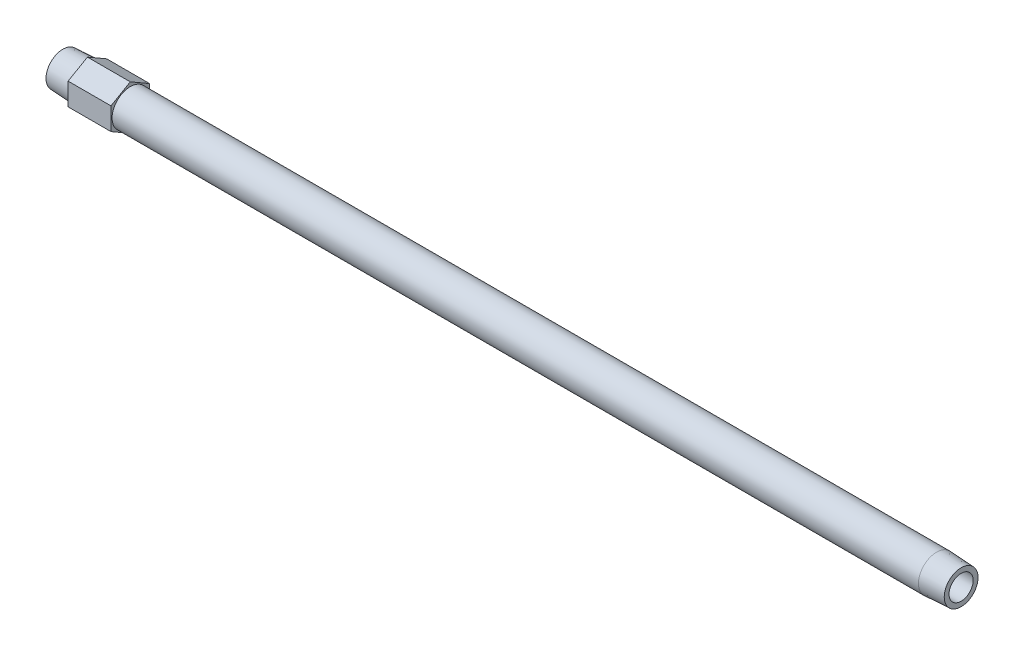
ISO-10303-21;
HEADER;
FILE_DESCRIPTION(('STEP AP214'),'2;1');
FILE_NAME('part.step','',(''),(''),'','','');
FILE_SCHEMA(('AUTOMOTIVE_DESIGN { 1 0 10303 214 1 1 1 1 }'));
ENDSEC;
DATA;
#1=APPLICATION_CONTEXT('core data for automotive mechanical design processes');
#2=APPLICATION_PROTOCOL_DEFINITION('international standard','automotive_design',2000,#1);
#3=PRODUCT_CONTEXT('',#1,'mechanical');
#4=PRODUCT('Part','Part','',(#3));
#5=PRODUCT_RELATED_PRODUCT_CATEGORY('part','',(#4));
#6=PRODUCT_DEFINITION_FORMATION('','',#4);
#7=PRODUCT_DEFINITION_CONTEXT('part definition',#1,'design');
#8=PRODUCT_DEFINITION('design','',#6,#7);
#9=PRODUCT_DEFINITION_SHAPE('','',#8);
#10=(LENGTH_UNIT() NAMED_UNIT(*) SI_UNIT(.MILLI.,.METRE.));
#11=(NAMED_UNIT(*) PLANE_ANGLE_UNIT() SI_UNIT($,.RADIAN.));
#12=(NAMED_UNIT(*) SI_UNIT($,.STERADIAN.) SOLID_ANGLE_UNIT());
#13=UNCERTAINTY_MEASURE_WITH_UNIT(LENGTH_MEASURE(1.E-05),#10,'distance_accuracy_value','');
#14=(GEOMETRIC_REPRESENTATION_CONTEXT(3) GLOBAL_UNCERTAINTY_ASSIGNED_CONTEXT((#13)) GLOBAL_UNIT_ASSIGNED_CONTEXT((#10,
#11,#12)) REPRESENTATION_CONTEXT('',''));
#15=CARTESIAN_POINT('',(0.,0.,0.));
#16=DIRECTION('',(0.,0.,1.));
#17=DIRECTION('',(1.,0.,0.));
#18=AXIS2_PLACEMENT_3D('',#15,#16,#17);
#19=CARTESIAN_POINT('',(0.,0.,-4.78009397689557));
#20=DIRECTION('',(1.,0.,0.));
#21=DIRECTION('',(0.,0.,-1.));
#22=AXIS2_PLACEMENT_3D('',#19,#20,#21);
#23=PLANE('',#22);
#24=CARTESIAN_POINT('',(0.,0.,0.));
#25=DIRECTION('',(-1.,0.,0.));
#26=DIRECTION('',(0.,0.,1.));
#27=AXIS2_PLACEMENT_3D('',#24,#25,#26);
#28=CIRCLE('',#27,4.78009397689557);
#29=CARTESIAN_POINT('',(0.,0.,4.78009397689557));
#30=VERTEX_POINT('',#29);
#31=EDGE_CURVE('E147',#30,#30,#28,.T.);
#32=ORIENTED_EDGE('',*,*,#31,.T.);
#33=EDGE_LOOP('',(#32));
#34=FACE_BOUND('',#33,.T.);
#35=CARTESIAN_POINT('',(0.,0.,0.));
#36=DIRECTION('',(1.,0.,0.));
#37=DIRECTION('',(0.,0.,1.));
#38=AXIS2_PLACEMENT_3D('',#35,#36,#37);
#39=CIRCLE('',#38,3.4163);
#40=CARTESIAN_POINT('',(0.,0.,3.4163));
#41=VERTEX_POINT('',#40);
#42=EDGE_CURVE('E159',#41,#41,#39,.T.);
#43=ORIENTED_EDGE('',*,*,#42,.T.);
#44=EDGE_LOOP('',(#43));
#45=FACE_BOUND('',#44,.T.);
#46=ADVANCED_FACE('F15',(#34,#45),#23,.F.);
#47=CARTESIAN_POINT('',(254.,0.,-4.78009397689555));
#48=DIRECTION('',(-1.,0.,0.));
#49=DIRECTION('',(0.,0.,1.));
#50=AXIS2_PLACEMENT_3D('',#47,#48,#49);
#51=PLANE('',#50);
#52=CARTESIAN_POINT('',(254.,0.,0.));
#53=DIRECTION('',(-1.,0.,0.));
#54=DIRECTION('',(0.,0.,1.));
#55=AXIS2_PLACEMENT_3D('',#52,#53,#54);
#56=CIRCLE('',#55,4.78009397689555);
#57=CARTESIAN_POINT('',(254.,0.,4.78009397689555));
#58=VERTEX_POINT('',#57);
#59=EDGE_CURVE('E150',#58,#58,#56,.T.);
#60=ORIENTED_EDGE('',*,*,#59,.F.);
#61=EDGE_LOOP('',(#60));
#62=FACE_BOUND('',#61,.T.);
#63=CARTESIAN_POINT('',(254.,0.,0.));
#64=DIRECTION('',(-1.,0.,0.));
#65=DIRECTION('',(0.,0.,1.));
#66=AXIS2_PLACEMENT_3D('',#63,#64,#65);
#67=CIRCLE('',#66,3.4163);
#68=CARTESIAN_POINT('',(254.,0.,3.4163));
#69=VERTEX_POINT('',#68);
#70=EDGE_CURVE('E156',#69,#69,#67,.F.);
#71=ORIENTED_EDGE('',*,*,#70,.F.);
#72=EDGE_LOOP('',(#71));
#73=FACE_BOUND('',#72,.T.);
#74=ADVANCED_FACE('F178',(#62,#73),#51,.F.);
#75=CARTESIAN_POINT('',(19.05,-9.45872946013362,5.461));
#76=DIRECTION('',(-1.,0.,0.));
#77=DIRECTION('',(0.,-1.,0.));
#78=AXIS2_PLACEMENT_3D('',#75,#76,#77);
#79=PLANE('',#78);
#80=DIRECTION('',(0.,0.5,-0.866025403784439));
#81=VECTOR('',#80,1.);
#82=CARTESIAN_POINT('',(19.05,-6.30581964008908,0.));
#83=LINE('',#82,#81);
#84=CARTESIAN_POINT('',(19.05,-6.30581964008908,0.));
#85=VERTEX_POINT('',#84);
#86=CARTESIAN_POINT('',(19.05,-3.15290982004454,-5.461));
#87=VERTEX_POINT('',#86);
#88=EDGE_CURVE('E103',#85,#87,#83,.T.);
#89=ORIENTED_EDGE('',*,*,#88,.T.);
#90=DIRECTION('',(0.,1.,0.));
#91=VECTOR('',#90,1.);
#92=CARTESIAN_POINT('',(19.05,-3.15290982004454,-5.461));
#93=LINE('',#92,#91);
#94=CARTESIAN_POINT('',(19.05,3.15290982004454,-5.461));
#95=VERTEX_POINT('',#94);
#96=EDGE_CURVE('E83',#87,#95,#93,.T.);
#97=ORIENTED_EDGE('',*,*,#96,.T.);
#98=DIRECTION('',(0.,0.5,0.866025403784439));
#99=VECTOR('',#98,1.);
#100=CARTESIAN_POINT('',(19.05,3.15290982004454,-5.461));
#101=LINE('',#100,#99);
#102=CARTESIAN_POINT('',(19.05,6.30581964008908,0.));
#103=VERTEX_POINT('',#102);
#104=EDGE_CURVE('E102',#95,#103,#101,.T.);
#105=ORIENTED_EDGE('',*,*,#104,.T.);
#106=DIRECTION('',(0.,-0.5,0.866025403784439));
#107=VECTOR('',#106,1.);
#108=CARTESIAN_POINT('',(19.05,6.30581964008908,0.));
#109=LINE('',#108,#107);
#110=CARTESIAN_POINT('',(19.05,3.15290982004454,5.461));
#111=VERTEX_POINT('',#110);
#112=EDGE_CURVE('E105',#103,#111,#109,.T.);
#113=ORIENTED_EDGE('',*,*,#112,.T.);
#114=DIRECTION('',(0.,-1.,0.));
#115=VECTOR('',#114,1.);
#116=CARTESIAN_POINT('',(19.05,3.15290982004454,5.461));
#117=LINE('',#116,#115);
#118=CARTESIAN_POINT('',(19.05,-3.15290982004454,5.461));
#119=VERTEX_POINT('',#118);
#120=EDGE_CURVE('E35',#111,#119,#117,.T.);
#121=ORIENTED_EDGE('',*,*,#120,.T.);
#122=DIRECTION('',(0.,-0.5,-0.866025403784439));
#123=VECTOR('',#122,1.);
#124=CARTESIAN_POINT('',(19.05,-3.15290982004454,5.461));
#125=LINE('',#124,#123);
#126=EDGE_CURVE('E30',#119,#85,#125,.T.);
#127=ORIENTED_EDGE('',*,*,#126,.T.);
#128=EDGE_LOOP('',(#89,#97,#105,#113,#121,#127));
#129=FACE_BOUND('',#128,.T.);
#130=CARTESIAN_POINT('',(19.05,0.,0.));
#131=DIRECTION('',(-1.,0.,0.));
#132=DIRECTION('',(0.,-1.,0.));
#133=AXIS2_PLACEMENT_3D('',#130,#131,#132);
#134=CIRCLE('',#133,5.1435);
#135=CARTESIAN_POINT('',(19.05,-5.1435,0.));
#136=VERTEX_POINT('',#135);
#137=EDGE_CURVE('E89',#136,#136,#134,.F.);
#138=ORIENTED_EDGE('',*,*,#137,.F.);
#139=EDGE_LOOP('',(#138));
#140=FACE_BOUND('',#139,.T.);
#141=ADVANCED_FACE('F124',(#129,#140),#79,.F.);
#142=CARTESIAN_POINT('',(6.9342,-9.45872946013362,5.461));
#143=DIRECTION('',(-1.,0.,0.));
#144=DIRECTION('',(0.,-1.,0.));
#145=AXIS2_PLACEMENT_3D('',#142,#143,#144);
#146=PLANE('',#145);
#147=DIRECTION('',(0.,0.5,-0.866025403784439));
#148=VECTOR('',#147,1.);
#149=CARTESIAN_POINT('',(6.9342,-6.30581964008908,0.));
#150=LINE('',#149,#148);
#151=CARTESIAN_POINT('',(6.9342,-6.30581964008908,0.));
#152=VERTEX_POINT('',#151);
#153=CARTESIAN_POINT('',(6.9342,-3.15290982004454,-5.461));
#154=VERTEX_POINT('',#153);
#155=EDGE_CURVE('E73',#152,#154,#150,.T.);
#156=ORIENTED_EDGE('',*,*,#155,.F.);
#157=DIRECTION('',(0.,-0.5,-0.866025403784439));
#158=VECTOR('',#157,1.);
#159=CARTESIAN_POINT('',(6.9342,-3.15290982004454,5.461));
#160=LINE('',#159,#158);
#161=CARTESIAN_POINT('',(6.9342,-3.15290982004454,5.461));
#162=VERTEX_POINT('',#161);
#163=EDGE_CURVE('E99',#162,#152,#160,.T.);
#164=ORIENTED_EDGE('',*,*,#163,.F.);
#165=DIRECTION('',(0.,-1.,0.));
#166=VECTOR('',#165,1.);
#167=CARTESIAN_POINT('',(6.9342,3.15290982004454,5.461));
#168=LINE('',#167,#166);
#169=CARTESIAN_POINT('',(6.9342,3.15290982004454,5.461));
#170=VERTEX_POINT('',#169);
#171=EDGE_CURVE('E133',#170,#162,#168,.T.);
#172=ORIENTED_EDGE('',*,*,#171,.F.);
#173=DIRECTION('',(0.,-0.5,0.866025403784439));
#174=VECTOR('',#173,1.);
#175=CARTESIAN_POINT('',(6.9342,6.30581964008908,0.));
#176=LINE('',#175,#174);
#177=CARTESIAN_POINT('',(6.9342,6.30581964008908,0.));
#178=VERTEX_POINT('',#177);
#179=EDGE_CURVE('E129',#178,#170,#176,.T.);
#180=ORIENTED_EDGE('',*,*,#179,.F.);
#181=DIRECTION('',(0.,0.5,0.866025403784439));
#182=VECTOR('',#181,1.);
#183=CARTESIAN_POINT('',(6.9342,3.15290982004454,-5.461));
#184=LINE('',#183,#182);
#185=CARTESIAN_POINT('',(6.9342,3.15290982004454,-5.461));
#186=VERTEX_POINT('',#185);
#187=EDGE_CURVE('E75',#186,#178,#184,.T.);
#188=ORIENTED_EDGE('',*,*,#187,.F.);
#189=DIRECTION('',(0.,1.,0.));
#190=VECTOR('',#189,1.);
#191=CARTESIAN_POINT('',(6.9342,-3.15290982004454,-5.461));
#192=LINE('',#191,#190);
#193=EDGE_CURVE('E68',#154,#186,#192,.T.);
#194=ORIENTED_EDGE('',*,*,#193,.F.);
#195=EDGE_LOOP('',(#156,#164,#172,#180,#188,#194));
#196=FACE_BOUND('',#195,.T.);
#197=CARTESIAN_POINT('',(6.9342,0.,0.));
#198=DIRECTION('',(-1.,0.,0.));
#199=DIRECTION('',(0.,0.,1.));
#200=AXIS2_PLACEMENT_3D('',#197,#198,#199);
#201=CIRCLE('',#200,5.1435);
#202=CARTESIAN_POINT('',(6.9342,0.,5.1435));
#203=VERTEX_POINT('',#202);
#204=EDGE_CURVE('E95',#203,#203,#201,.T.);
#205=ORIENTED_EDGE('',*,*,#204,.F.);
#206=EDGE_LOOP('',(#205));
#207=FACE_BOUND('',#206,.T.);
#208=ADVANCED_FACE('F69',(#196,#207),#146,.T.);
#209=CARTESIAN_POINT('',(19.05,-6.30581964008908,0.));
#210=DIRECTION('',(0.,0.866025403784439,0.5));
#211=DIRECTION('',(0.,-0.5,0.866025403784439));
#212=AXIS2_PLACEMENT_3D('',#209,#210,#211);
#213=PLANE('',#212);
#214=ORIENTED_EDGE('',*,*,#155,.T.);
#215=DIRECTION('',(-1.,0.,0.));
#216=VECTOR('',#215,1.);
#217=CARTESIAN_POINT('',(19.05,-3.15290982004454,-5.461));
#218=LINE('',#217,#216);
#219=EDGE_CURVE('E10',#87,#154,#218,.T.);
#220=ORIENTED_EDGE('',*,*,#219,.F.);
#221=ORIENTED_EDGE('',*,*,#88,.F.);
#222=DIRECTION('',(-1.,0.,0.));
#223=VECTOR('',#222,1.);
#224=CARTESIAN_POINT('',(19.05,-6.30581964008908,0.));
#225=LINE('',#224,#223);
#226=EDGE_CURVE('E87',#85,#152,#225,.T.);
#227=ORIENTED_EDGE('',*,*,#226,.T.);
#228=EDGE_LOOP('',(#214,#220,#221,#227));
#229=FACE_BOUND('',#228,.T.);
#230=ADVANCED_FACE('F17',(#229),#213,.F.);
#231=CARTESIAN_POINT('',(19.05,-3.15290982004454,-5.461));
#232=DIRECTION('',(0.,0.,1.));
#233=DIRECTION('',(0.,-1.,0.));
#234=AXIS2_PLACEMENT_3D('',#231,#232,#233);
#235=PLANE('',#234);
#236=ORIENTED_EDGE('',*,*,#193,.T.);
#237=DIRECTION('',(-1.,0.,0.));
#238=VECTOR('',#237,1.);
#239=CARTESIAN_POINT('',(19.05,3.15290982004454,-5.461));
#240=LINE('',#239,#238);
#241=EDGE_CURVE('E23',#95,#186,#240,.T.);
#242=ORIENTED_EDGE('',*,*,#241,.F.);
#243=ORIENTED_EDGE('',*,*,#96,.F.);
#244=ORIENTED_EDGE('',*,*,#219,.T.);
#245=EDGE_LOOP('',(#236,#242,#243,#244));
#246=FACE_BOUND('',#245,.T.);
#247=ADVANCED_FACE('F82',(#246),#235,.F.);
#248=CARTESIAN_POINT('',(19.05,3.15290982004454,-5.461));
#249=DIRECTION('',(0.,-0.866025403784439,0.5));
#250=DIRECTION('',(0.,-0.5,-0.866025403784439));
#251=AXIS2_PLACEMENT_3D('',#248,#249,#250);
#252=PLANE('',#251);
#253=ORIENTED_EDGE('',*,*,#187,.T.);
#254=DIRECTION('',(-1.,0.,0.));
#255=VECTOR('',#254,1.);
#256=CARTESIAN_POINT('',(19.05,6.30581964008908,0.));
#257=LINE('',#256,#255);
#258=EDGE_CURVE('E117',#103,#178,#257,.T.);
#259=ORIENTED_EDGE('',*,*,#258,.F.);
#260=ORIENTED_EDGE('',*,*,#104,.F.);
#261=ORIENTED_EDGE('',*,*,#241,.T.);
#262=EDGE_LOOP('',(#253,#259,#260,#261));
#263=FACE_BOUND('',#262,.T.);
#264=ADVANCED_FACE('F121',(#263),#252,.F.);
#265=CARTESIAN_POINT('',(19.05,6.30581964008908,0.));
#266=DIRECTION('',(0.,-0.866025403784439,-0.5));
#267=DIRECTION('',(0.,0.5,-0.866025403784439));
#268=AXIS2_PLACEMENT_3D('',#265,#266,#267);
#269=PLANE('',#268);
#270=ORIENTED_EDGE('',*,*,#179,.T.);
#271=DIRECTION('',(-1.,0.,0.));
#272=VECTOR('',#271,1.);
#273=CARTESIAN_POINT('',(19.05,3.15290982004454,5.461));
#274=LINE('',#273,#272);
#275=EDGE_CURVE('E114',#111,#170,#274,.T.);
#276=ORIENTED_EDGE('',*,*,#275,.F.);
#277=ORIENTED_EDGE('',*,*,#112,.F.);
#278=ORIENTED_EDGE('',*,*,#258,.T.);
#279=EDGE_LOOP('',(#270,#276,#277,#278));
#280=FACE_BOUND('',#279,.T.);
#281=ADVANCED_FACE('F128',(#280),#269,.F.);
#282=CARTESIAN_POINT('',(19.05,3.15290982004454,5.461));
#283=DIRECTION('',(0.,0.,-1.));
#284=DIRECTION('',(-1.,0.,0.));
#285=AXIS2_PLACEMENT_3D('',#282,#283,#284);
#286=PLANE('',#285);
#287=ORIENTED_EDGE('',*,*,#171,.T.);
#288=DIRECTION('',(-1.,0.,0.));
#289=VECTOR('',#288,1.);
#290=CARTESIAN_POINT('',(19.05,-3.15290982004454,5.461));
#291=LINE('',#290,#289);
#292=EDGE_CURVE('E111',#119,#162,#291,.T.);
#293=ORIENTED_EDGE('',*,*,#292,.F.);
#294=ORIENTED_EDGE('',*,*,#120,.F.);
#295=ORIENTED_EDGE('',*,*,#275,.T.);
#296=EDGE_LOOP('',(#287,#293,#294,#295));
#297=FACE_BOUND('',#296,.T.);
#298=ADVANCED_FACE('F132',(#297),#286,.F.);
#299=CARTESIAN_POINT('',(19.05,-3.15290982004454,5.461));
#300=DIRECTION('',(0.,0.866025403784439,-0.5));
#301=DIRECTION('',(0.,0.5,0.866025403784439));
#302=AXIS2_PLACEMENT_3D('',#299,#300,#301);
#303=PLANE('',#302);
#304=ORIENTED_EDGE('',*,*,#163,.T.);
#305=ORIENTED_EDGE('',*,*,#226,.F.);
#306=ORIENTED_EDGE('',*,*,#126,.F.);
#307=ORIENTED_EDGE('',*,*,#292,.T.);
#308=EDGE_LOOP('',(#304,#305,#306,#307));
#309=FACE_BOUND('',#308,.T.);
#310=ADVANCED_FACE('F135',(#309),#303,.F.);
#311=CARTESIAN_POINT('',(6.9342,0.,0.));
#312=DIRECTION('',(1.,0.,0.));
#313=DIRECTION('',(0.,0.,-1.));
#314=AXIS2_PLACEMENT_3D('',#311,#312,#313);
#315=CONICAL_SURFACE('',#314,5.1435,0.0523598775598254);
#316=ORIENTED_EDGE('',*,*,#31,.F.);
#317=EDGE_LOOP('',(#316));
#318=FACE_BOUND('',#317,.T.);
#319=ORIENTED_EDGE('',*,*,#204,.T.);
#320=EDGE_LOOP('',(#319));
#321=FACE_BOUND('',#320,.T.);
#322=ADVANCED_FACE('F187',(#318,#321),#315,.T.);
#323=CARTESIAN_POINT('',(-60.,0.,0.));
#324=DIRECTION('',(-1.,0.,0.));
#325=DIRECTION('',(0.,0.,1.));
#326=AXIS2_PLACEMENT_3D('',#323,#324,#325);
#327=CYLINDRICAL_SURFACE('',#326,5.1435);
#328=ORIENTED_EDGE('',*,*,#137,.T.);
#329=EDGE_LOOP('',(#328));
#330=FACE_BOUND('',#329,.T.);
#331=CARTESIAN_POINT('',(247.0658,0.,0.));
#332=DIRECTION('',(-1.,0.,0.));
#333=DIRECTION('',(0.,0.,1.));
#334=AXIS2_PLACEMENT_3D('',#331,#332,#333);
#335=CIRCLE('',#334,5.1435);
#336=CARTESIAN_POINT('',(247.0658,0.,5.1435));
#337=VERTEX_POINT('',#336);
#338=EDGE_CURVE('E153',#337,#337,#335,.T.);
#339=ORIENTED_EDGE('',*,*,#338,.T.);
#340=EDGE_LOOP('',(#339));
#341=FACE_BOUND('',#340,.T.);
#342=ADVANCED_FACE('F174',(#330,#341),#327,.T.);
#343=CARTESIAN_POINT('',(254.,0.,0.));
#344=DIRECTION('',(-1.,0.,0.));
#345=DIRECTION('',(0.,0.,1.));
#346=AXIS2_PLACEMENT_3D('',#343,#344,#345);
#347=CONICAL_SURFACE('',#346,4.78009397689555,0.052359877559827);
#348=ORIENTED_EDGE('',*,*,#338,.F.);
#349=EDGE_LOOP('',(#348));
#350=FACE_BOUND('',#349,.T.);
#351=ORIENTED_EDGE('',*,*,#59,.T.);
#352=EDGE_LOOP('',(#351));
#353=FACE_BOUND('',#352,.T.);
#354=ADVANCED_FACE('F167',(#350,#353),#347,.T.);
#355=CARTESIAN_POINT('',(254.547330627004,0.,0.));
#356=DIRECTION('',(-1.,0.,0.));
#357=DIRECTION('',(0.,0.,1.));
#358=AXIS2_PLACEMENT_3D('',#355,#356,#357);
#359=CYLINDRICAL_SURFACE('',#358,3.4163);
#360=ORIENTED_EDGE('',*,*,#70,.T.);
#361=EDGE_LOOP('',(#360));
#362=FACE_BOUND('',#361,.T.);
#363=ORIENTED_EDGE('',*,*,#42,.F.);
#364=EDGE_LOOP('',(#363));
#365=FACE_BOUND('',#364,.T.);
#366=ADVANCED_FACE('F165',(#362,#365),#359,.F.);
#367=CLOSED_SHELL('',(#46,#74,#141,#208,#230,#247,#264,#281,#298,#310,#322,#342,#354,#366));
#368=MANIFOLD_SOLID_BREP('B1',#367);
#369=ADVANCED_BREP_SHAPE_REPRESENTATION('',(#18,#368),#14);
#370=SHAPE_DEFINITION_REPRESENTATION(#9,#369);
ENDSEC;
END-ISO-10303-21;
